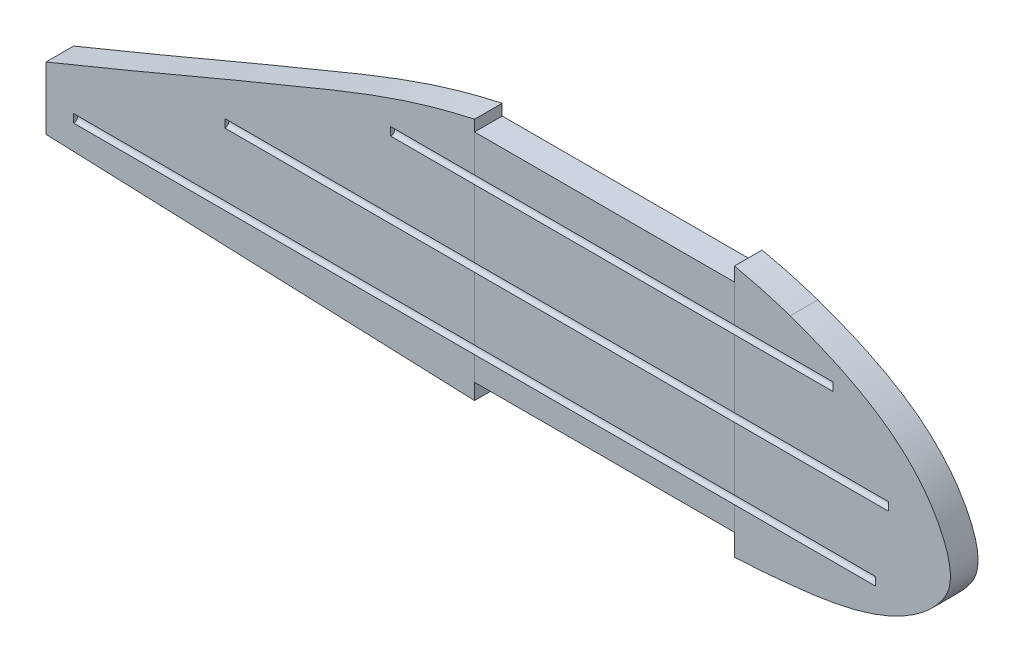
from build123d import *

# Parameters (mm, degrees)
BOSS_EXTRUDE1_DEPTH = 10
CUT_EXTRUDE1_DEPTH  = 183.514405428
CUT_EXTRUDE2_START  = -10
SKETCH5_R           = 1.5
CUT_EXTRUDE2_DEPTH  = 290
CUT_EXTRUDE3_START  = -110
SKETCH6_R           = 1.5
CUT_EXTRUDE3_DEPTH  = 240
CUT_EXTRUDE4_START  = -50
SKETCH7_R           = 1.5
CUT_EXTRUDE4_DEPTH  = 160
BOSS_EXTRUDE2_START = 160
BOSS_EXTRUDE2_DEPTH = 160
BOSS_EXTRUDE3_START = 240
BOSS_EXTRUDE3_DEPTH = 240
BOSS_EXTRUDE4_START = 290
BOSS_EXTRUDE4_DEPTH = 290


with BuildPart() as part:
    # Sketch1 → Boss-Extrude1 (new body)
    with BuildSketch(Plane.XY):
        with BuildLine():
            Line((-174.661434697, -35.796829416), (-22.261434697, -41.595364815))
            Line((-22.261434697, -41.595364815), (-22.261434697, -29.578604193))
            Line((-22.261434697, -29.578604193), (-22.261434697, 38.496919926))
            Line((-22.261434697, 38.496919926), (-22.261434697, 45.856919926))
            add(Edge.make_bspline(
                [(-174.661434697, -13.132150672), (-142.163116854, 0.005980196), (-98.820480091, 18.900773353), (-48.101789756, 39.122679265), (-29.262647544, 44.256757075), (-22.261434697, 45.856919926)],
                knots=[0, 0, 0, 0, 0.37297714, 0.504219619, 0.580660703, 0.580660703, 0.580660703, 0.580660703], degree=3))
            Line((-174.661434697, -13.132150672), (-174.661434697, -35.796829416))
        make_face()
        with BuildLine():
            Line((-22.261434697, -41.595364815), (43.949411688, -44.114563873))
            Line((43.949411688, -44.114563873), (57.305758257, -44.064861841))
            add(Edge.make_bspline(
                [(94.503261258, 41.945710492), (112.79228528, 35.396643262), (135.085795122, 24.884145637), (149.376344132, 2.386740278), (152.743644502, -7.756490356), (152.315910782, -15.166027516), (147.688421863, -22.722062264), (133.927469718, -34.520766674), (112.357130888, -40.452488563), (91.259209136, -42.569135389), (74.760889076, -43.971819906), (63.843577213, -43.944111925), (57.305758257, -44.064861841)],
                knots=[0.590927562, 0.590927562, 0.590927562, 0.590927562, 0.703710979, 0.737073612, 0.756629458, 0.770481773, 0.78224573, 0.811517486, 0.882896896, 0.918428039, 0.946042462, 0.987358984, 0.987358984, 0.987358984, 0.987358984], degree=3))
            add(Edge.make_bspline(
                [(-22.261434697, 45.856919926), (-11.453122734, 48.327214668), (27.522964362, 54.653532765), (67.523455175, 50.996675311), (94.503261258, 41.945710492)],
                knots=[0.580660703, 0.580660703, 0.580660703, 0.580660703, 0.698668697, 1, 1, 1, 1], degree=3))
            Line((-22.261434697, 45.856919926), (-22.261434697, 38.496919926))
            Line((-22.261434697, 38.496919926), (-22.261434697, -29.578604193))
            Line((-22.261434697, -29.578604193), (-22.261434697, -41.595364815))
        make_face()
    extrude(amount=BOSS_EXTRUDE1_DEPTH)

    # Sketch2 → Cut-Extrude1 (cut, through all)
    with BuildSketch(Plane.XY.offset(10)):
        with BuildLine():
            Line((74.338565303, -35.944289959), (74.338565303, -43.746864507))
            add(Edge.make_bspline(
                [(57.305758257, -44.064861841), (62.982596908, -43.960013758), (68.663890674, -43.958727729), (74.338565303, -43.746864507)],
                knots=[0.590927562, 0.590927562, 0.590927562, 0.590927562, 0.626803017, 0.626803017, 0.626803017, 0.626803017], degree=3))
            Line((57.305758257, -44.064861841), (43.949411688, -44.114563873))
            Line((43.949411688, -44.114563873), (-19.661434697, -41.694289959))
            Line((-19.661434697, -41.694289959), (-19.661434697, -35.944289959))
            Line((-19.661434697, -35.944289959), (74.338565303, -35.944289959))
        make_face()
        with BuildLine():
            Line((-19.661434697, 46.437138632), (-19.661434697, 42.437138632))
            Line((-19.661434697, 42.437138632), (74.338565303, 42.437138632))
            Line((74.338565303, 42.437138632), (74.338565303, 47.471078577))
            add(Edge.make_bspline(
                [(-19.661434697, 46.437138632), (-9.695649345, 48.607319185), (21.541523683, 53.494284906), (53.435906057, 51.976513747), (74.338565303, 47.471078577)],
                knots=[0.590112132, 0.590112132, 0.590112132, 0.590112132, 0.698668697, 0.925990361, 0.925990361, 0.925990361, 0.925990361], degree=3))
        make_face()
    extrude(amount=-CUT_EXTRUDE1_DEPTH, mode=Mode.SUBTRACT)

    # Sketch5 → Cut-Extrude2 (cut)
    with BuildSketch(Plane.ZY.offset(174.661434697).offset(CUT_EXTRUDE2_START)):
        with Locations((0, -25.796829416)):
            Circle(SKETCH5_R)
    cut_extrude2 = extrude(amount=-CUT_EXTRUDE2_DEPTH, mode=Mode.SUBTRACT)

    # Sketch6 → Cut-Extrude3 (cut)
    with BuildSketch(Plane(origin=(0, 0, 0), x_dir=(0, 0, -1), z_dir=(1, 0, 0)).offset(CUT_EXTRUDE3_START)):
        Circle(SKETCH6_R)
    cut_extrude3 = extrude(amount=CUT_EXTRUDE3_DEPTH, mode=Mode.SUBTRACT)

    # Sketch7 → Cut-Extrude4 (cut)
    with BuildSketch(Plane(origin=(0, 0, 0), x_dir=(0, 0, -1), z_dir=(1, 0, 0)).offset(CUT_EXTRUDE4_START)):
        with Locations((0, 27.471078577)):
            Circle(SKETCH7_R)
    cut_extrude4 = extrude(amount=CUT_EXTRUDE4_DEPTH, mode=Mode.SUBTRACT)

    # Mirror1: Cut-Extrude2, Cut-Extrude3, Cut-Extrude4 across plane
    add(cut_extrude2.mirror(Plane(origin=(0, 0, 5), x_dir=(1, 0, 0), z_dir=(0, 0, -1))), mode=Mode.SUBTRACT)
    add(cut_extrude3.mirror(Plane(origin=(0, 0, 5), x_dir=(1, 0, 0), z_dir=(0, 0, -1))), mode=Mode.SUBTRACT)
    add(cut_extrude4.mirror(Plane(origin=(0, 0, 5), x_dir=(1, 0, 0), z_dir=(0, 0, -1))), mode=Mode.SUBTRACT)

    # Sketch9 → Boss-Extrude2 (add)
    with BuildSketch(Plane.ZY.offset(-110).offset(BOSS_EXTRUDE2_START)):
        with BuildLine():
            Line((0, 28.971078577), (0, 25.971078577))
            ThreePointArc((0, 25.971078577), (1.5, 27.471078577), (0, 28.971078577))
        make_face()
    extrude(amount=-BOSS_EXTRUDE2_DEPTH)

    # Sketch10 → Boss-Extrude3 (add)
    with BuildSketch(Plane.ZY.offset(-130).offset(BOSS_EXTRUDE3_START)):
        with BuildLine():
            Line((0, 1.5), (0, -1.5))
            ThreePointArc((0, -1.5), (1.5, 0), (0, 1.5))
        make_face()
    extrude(amount=-BOSS_EXTRUDE3_DEPTH)

    # Sketch11 → Boss-Extrude4 (add)
    with BuildSketch(Plane.ZY.offset(-125.338565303).offset(BOSS_EXTRUDE4_START)):
        with BuildLine():
            Line((0, -24.296829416), (0, -27.296829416))
            ThreePointArc((0, -27.296829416), (1.5, -25.796829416), (0, -24.296829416))
        make_face()
    extrude(amount=-BOSS_EXTRUDE4_DEPTH)


solid = part.part
